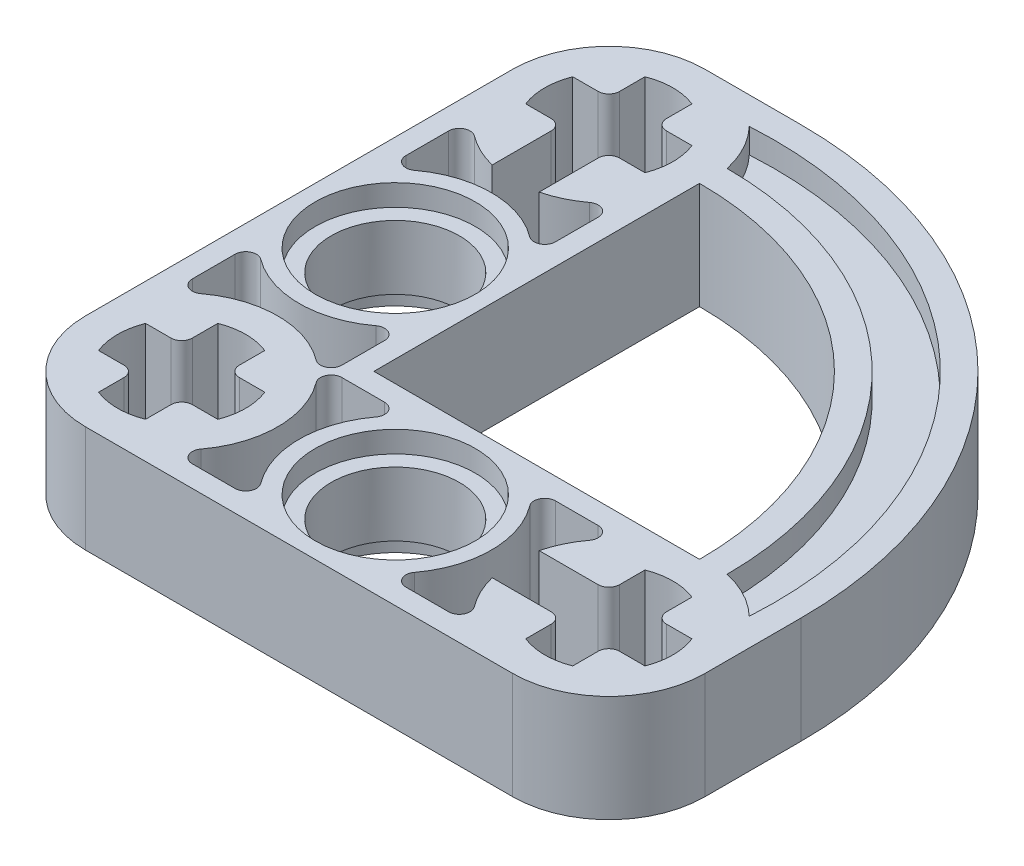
from build123d import *

# Parameters (mm, degrees)
EXTRUDE_1_DEPTH      = 4
CUT_EXTRUDE_1_DEPTH  = 24.160120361
CUT_EXTRUDE_2_DEPTH  = 24.160120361
CUT_EXTRUDE_3_DEPTH  = 24.160120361
CUT_EXTRUDE_4_DEPTH  = 24.160120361
CUT_EXTRUDE_5_DEPTH  = 1
CUT_EXTRUDE_START    = -1
CUT_EXTRUDE_8_DEPTH  = 1
FILLET_1_R           = 0.5
FILLET_2_R           = 3.6
CUT_EXTRUDE_13_DEPTH = 1
BOSS_EXTRUDE1_DEPTH  = 4
SKETCH2_R            = 2.4
CUT_EXTRUDE1_DEPTH   = 24.160120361
SKETCH4_R            = 3
CUT_EXTRUDE2_DEPTH   = 0.8
CUT_EXTRUDE3_START   = -0.8
SKETCH5_R            = 3
CUT_EXTRUDE3_DEPTH   = 0.8


with BuildPart() as part:
    # Sketch 1 → Extrude 1 (new body)
    with BuildSketch(Plane(origin=(0, 3.925, 0), x_dir=(1, 0, 0), z_dir=(0, 1, 0))):
        with BuildLine():
            Line((-11.545003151, 3.589996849), (-11.545003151, -19.610003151))
            Line((-11.545003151, -19.610003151), (11.654996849, -19.610003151))
            Line((11.654996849, -19.610003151), (11.654996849, -12.410003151))
            ThreePointArc((11.654996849, -12.410003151), (6.968705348, -1.096294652), (-4.345003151, 3.589996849))
            Line((-4.345003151, 3.589996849), (-11.545003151, 3.589996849))
        make_face()
        with BuildLine():
            Line((-4.345003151, -12.410003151), (-4.345003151, -0.212116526))
            ThreePointArc((-4.345003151, -0.212116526), (4.280205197, -3.784794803), (7.852883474, -12.410003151))
            Line((7.852883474, -12.410003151), (-4.345003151, -12.410003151))
        make_face(mode=Mode.SUBTRACT)
    extrude(amount=-EXTRUDE_1_DEPTH)

    # Sketch 2 → Cut-Extrude 1 (cut, through all)
    with BuildSketch(Plane(origin=(0, 3.925, 0), x_dir=(-1, 0, 0), z_dir=(0, 1, 0))):
        with BuildLine():
            Line((10.585278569, 3.194236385), (10.585278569, 4.774236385))
            ThreePointArc((10.585278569, 4.774236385), (10.43330167, 5.004217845), (10.162146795, 4.954584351))
            ThreePointArc((10.162146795, 4.954584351), (7.945003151, 4.24526029), (5.727859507, 4.954584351))
            ThreePointArc((5.727859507, 4.954584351), (5.456704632, 5.004217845), (5.304727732, 4.774236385))
            Line((5.304727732, 4.774236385), (5.304727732, 3.194236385))
            ThreePointArc((5.304727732, 3.194236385), (5.456704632, 2.964254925), (5.727859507, 3.013888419))
            ThreePointArc((5.727859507, 3.013888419), (6.402563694, 3.409993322), (7.145003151, 3.65678977))
            Line((7.145003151, 3.65678977), (7.145003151, 0.810003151))
            Line((7.145003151, 0.810003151), (5.545003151, 0.810003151))
            ThreePointArc((5.545003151, 0.810003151), (5.415181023, 0.010003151), (5.545003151, -0.789996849))
            Line((5.545003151, -0.789996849), (7.145003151, -0.789996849))
            Line((7.145003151, -0.789996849), (7.145003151, -2.389996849))
            ThreePointArc((7.145003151, -2.389996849), (7.945003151, -2.519818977), (8.745003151, -2.389996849))
            Line((8.745003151, -2.389996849), (8.745003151, -0.789996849))
            Line((8.745003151, -0.789996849), (10.345003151, -0.789996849))
            ThreePointArc((10.345003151, -0.789996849), (10.474825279, 0.010003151), (10.345003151, 0.810003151))
            Line((10.345003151, 0.810003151), (8.745003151, 0.810003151))
            Line((8.745003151, 0.810003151), (8.745003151, 3.65678977))
            ThreePointArc((8.745003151, 3.65678977), (9.487442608, 3.409993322), (10.162146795, 3.013888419))
            ThreePointArc((10.162146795, 3.013888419), (10.43330167, 2.964254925), (10.585278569, 3.194236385))
        make_face()
    extrude(amount=-CUT_EXTRUDE_1_DEPTH, mode=Mode.SUBTRACT)

    # Sketch 3 → Cut-Extrude 2 (cut, through all)
    with BuildSketch(Plane(origin=(0, 3.925, 0), x_dir=(-1, 0, 0), z_dir=(0, 1, 0))):
        with BuildLine():
            Line((-4.826110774, 13.560227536), (-3.246110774, 13.560227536))
            ThreePointArc((-3.246110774, 13.560227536), (-3.069334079, 13.633450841), (-2.996110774, 13.810227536))
            ThreePointArc((-2.996110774, 13.810227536), (-3.715011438, 16.010003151), (-2.996110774, 18.209778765))
            ThreePointArc((-2.996110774, 18.209778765), (-3.069334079, 18.386555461), (-3.246110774, 18.459778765))
            Line((-3.246110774, 18.459778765), (-4.826110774, 18.459778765))
            ThreePointArc((-4.826110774, 18.459778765), (-5.00288747, 18.386555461), (-5.076110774, 18.209778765))
            ThreePointArc((-5.076110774, 18.209778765), (-4.684277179, 17.543308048), (-4.439367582, 16.810003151))
            Line((-4.439367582, 16.810003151), (-7.254996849, 16.810003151))
            Line((-7.254996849, 16.810003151), (-7.254996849, 18.272744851))
            ThreePointArc((-7.254996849, 18.272744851), (-8.054996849, 18.410003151), (-8.854996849, 18.272744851))
            Line((-8.854996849, 18.272744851), (-8.854996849, 16.810003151))
            Line((-8.854996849, 16.810003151), (-10.317738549, 16.810003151))
            ThreePointArc((-10.317738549, 16.810003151), (-10.454996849, 16.010003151), (-10.317738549, 15.210003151))
            Line((-10.317738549, 15.210003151), (-8.854996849, 15.210003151))
            Line((-8.854996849, 15.210003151), (-8.854996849, 13.747261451))
            ThreePointArc((-8.854996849, 13.747261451), (-8.054996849, 13.610003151), (-7.254996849, 13.747261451))
            Line((-7.254996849, 13.747261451), (-7.254996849, 15.210003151))
            Line((-7.254996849, 15.210003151), (-4.439367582, 15.210003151))
            ThreePointArc((-4.439367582, 15.210003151), (-4.684277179, 14.476698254), (-5.076110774, 13.810227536))
            ThreePointArc((-5.076110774, 13.810227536), (-5.00288747, 13.633450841), (-4.826110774, 13.560227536))
        make_face()
    extrude(amount=-CUT_EXTRUDE_2_DEPTH, mode=Mode.SUBTRACT)

    # Sketch 4 → Cut-Extrude 3 (cut, through all)
    with BuildSketch(Plane(origin=(0, 3.925, 0), x_dir=(-1, 0, 0), z_dir=(0, 1, 0))):
        with BuildLine():
            Line((8.745003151, 13.747261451), (8.745003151, 15.210003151))
            Line((8.745003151, 15.210003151), (10.207744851, 15.210003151))
            ThreePointArc((10.207744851, 15.210003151), (10.345003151, 16.010003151), (10.207744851, 16.810003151))
            Line((10.207744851, 16.810003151), (8.745003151, 16.810003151))
            Line((8.745003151, 16.810003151), (8.745003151, 18.272744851))
            ThreePointArc((8.745003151, 18.272744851), (7.945003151, 18.410003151), (7.145003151, 18.272744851))
            Line((7.145003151, 18.272744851), (7.145003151, 16.810003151))
            Line((7.145003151, 16.810003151), (5.682261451, 16.810003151))
            ThreePointArc((5.682261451, 16.810003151), (5.545003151, 16.010003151), (5.682261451, 15.210003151))
            Line((5.682261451, 15.210003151), (7.145003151, 15.210003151))
            Line((7.145003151, 15.210003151), (7.145003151, 13.747261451))
            ThreePointArc((7.145003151, 13.747261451), (7.945003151, 13.610003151), (8.745003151, 13.747261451))
        make_face()
    extrude(amount=-CUT_EXTRUDE_3_DEPTH, mode=Mode.SUBTRACT)

    # Sketch 5 → Cut-Extrude 4 (cut, through all)
    with BuildSketch(Plane(origin=(0, 3.925, 0), x_dir=(-1, 0, 0), z_dir=(0, 1, 0))):
        with BuildLine():
            Line((5.605171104, 12.8875), (5.605171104, 11.3075))
            ThreePointArc((5.605171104, 11.3075), (5.678394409, 11.130723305), (5.855171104, 11.0575))
            ThreePointArc((5.855171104, 11.0575), (8.065, 11.785), (10.274828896, 11.0575))
            ThreePointArc((10.274828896, 11.0575), (10.451605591, 11.130723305), (10.524828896, 11.3075))
            Line((10.524828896, 11.3075), (10.524828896, 12.8875))
            ThreePointArc((10.524828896, 12.8875), (10.451605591, 13.064276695), (10.274828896, 13.1375))
            ThreePointArc((10.274828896, 13.1375), (8.065, 12.41), (5.855171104, 13.1375))
            ThreePointArc((5.855171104, 13.1375), (5.678394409, 13.064276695), (5.605171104, 12.8875))
        make_face()
    extrude(amount=-CUT_EXTRUDE_4_DEPTH, mode=Mode.SUBTRACT)

    # Sketch 6 → Cut-Extrude 5 (cut)
    with BuildSketch(Plane(origin=(0, 3.925, 0), x_dir=(-1, 0, 0), z_dir=(0, 1, 0))):
        with BuildLine():
            Line((4.8225, 18.589828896), (3.2425, 18.589828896))
            ThreePointArc((3.2425, 18.589828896), (3.065723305, 18.516605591), (2.9925, 18.339828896))
            ThreePointArc((2.9925, 18.339828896), (3.72, 16.13), (2.9925, 13.920171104))
            ThreePointArc((2.9925, 13.920171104), (3.065723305, 13.743394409), (3.2425, 13.670171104))
            Line((3.2425, 13.670171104), (4.8225, 13.670171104))
            ThreePointArc((4.8225, 13.670171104), (4.999276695, 13.743394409), (5.0725, 13.920171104))
            ThreePointArc((5.0725, 13.920171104), (4.345, 16.13), (5.0725, 18.339828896))
            ThreePointArc((5.0725, 18.339828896), (4.999276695, 18.516605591), (4.8225, 18.589828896))
        make_face()
    extrude(amount=-CUT_EXTRUDE_5_DEPTH, mode=Mode.SUBTRACT)

    # Sketch 9 → Cut-Extrude 8 (cut)
    with BuildSketch(Plane.XZ.offset(0.075).offset(CUT_EXTRUDE_START)):
        with BuildLine():
            Line((-3.2425, 18.589828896), (-4.8225, 18.589828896))
            ThreePointArc((-4.8225, 18.589828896), (-4.999276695, 18.516605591), (-5.0725, 18.339828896))
            ThreePointArc((-5.0725, 18.339828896), (-4.345, 16.13), (-5.0725, 13.920171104))
            ThreePointArc((-5.0725, 13.920171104), (-4.999276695, 13.743394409), (-4.8225, 13.670171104))
            Line((-4.8225, 13.670171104), (-3.2425, 13.670171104))
            ThreePointArc((-3.2425, 13.670171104), (-3.065723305, 13.743394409), (-2.9925, 13.920171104))
            ThreePointArc((-2.9925, 13.920171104), (-3.72, 16.13), (-2.9925, 18.339828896))
            ThreePointArc((-2.9925, 18.339828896), (-3.065723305, 18.516605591), (-3.2425, 18.589828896))
        make_face()
    extrude(amount=CUT_EXTRUDE_8_DEPTH, mode=Mode.SUBTRACT)

    # Sketch 14 → Cut-Revolve 1 (revolve, cut)
    with BuildSketch(Plane(origin=(0, 0, 16.13), x_dir=(-1, 0, 0), z_dir=(0, 0, -1)), mode=Mode.PRIVATE) as cut_revolve_1_sk:
        Polygon((-3, -0.075), (0, -0.075), (0, 3.925), (-3, 3.925), (-3, 3.525), (-2.4, 3.525), (-2.4, 0.325), (-3, 0.325), align=None)
    revolve(cut_revolve_1_sk.sketch.rotate(Axis((0, -0.075, 16.13), (0, 1, 0)), 270), axis=Axis((0, -0.075, 16.13), (0, 1, 0)), mode=Mode.SUBTRACT)

    # Sketch 17 → Cut-Revolve 4 (revolve, cut)
    with BuildSketch(Plane(origin=(0, 0, 8.065), x_dir=(-1, 0, 0), z_dir=(0, 0, -1)), mode=Mode.PRIVATE) as cut_revolve_4_sk:
        Polygon((5.065, -0.075), (8.065, -0.075), (8.065, 3.925), (5.065, 3.925), (5.065, 3.525), (5.665, 3.525), (5.665, 0.325), (5.065, 0.325), align=None)
    revolve(cut_revolve_4_sk.sketch.rotate(Axis((-8.065, -0.075, 8.065), (0, 1, 0)), 270), axis=Axis((-8.065, -0.075, 8.065), (0, 1, 0)), mode=Mode.SUBTRACT)

    # Fillet 1
    fillet_1_edges = [part.edges().sort_by_distance(p)[0] for p in [
        (7.254996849, 1.925, 15.210003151),
        (8.854996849, 1.925, 15.210003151),
        (8.854996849, 1.925, 16.810003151),
        (7.254996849, 1.925, 16.810003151),
        (-7.145003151, 1.925, 15.210003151),
        (-7.145003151, 1.925, 16.810003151),
        (-8.745003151, 1.925, 16.810003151),
        (-8.745003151, 1.925, 15.210003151),
        (-8.745003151, 1.925, 0.810003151),
        (-8.745003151, 1.925, -0.789996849),
        (-7.145003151, 1.925, -0.789996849),
        (-7.145003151, 1.925, 0.810003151),
    ]]
    fillet(fillet_1_edges, radius=FILLET_1_R)

    # Fillet 2
    fillet_2_edges = [part.edges().sort_by_distance(p)[0] for p in [
        (11.654996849, 1.925, 19.610003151),
        (-11.545003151, 1.925, 19.610003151),
        (-11.545003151, 1.925, -3.589996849),
    ]]
    fillet(fillet_2_edges, radius=FILLET_2_R)

    # Sketch 18 → Cut-Extrude 13 (cut)
    with BuildSketch(Plane.XZ.offset(0.075)):
        with BuildLine():
            ThreePointArc((8.852043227, 12.376393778), (9.806599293, 12.728191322), (10.630157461, 13.325427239))
            ThreePointArc((10.630157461, 13.325427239), (6.26380066, 1.80119934), (-5.260427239, -2.565157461))
            ThreePointArc((-5.260427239, -2.565157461), (-4.663191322, -1.741599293), (-4.311393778, -0.787043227))
            ThreePointArc((-4.311393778, -0.787043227), (4.986748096, 3.078251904), (8.852043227, 12.376393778))
        make_face()
    cut_extrude_13 = extrude(amount=-CUT_EXTRUDE_13_DEPTH, mode=Mode.SUBTRACT)

    # Mirror 1: Cut-Extrude 13 across plane
    add(cut_extrude_13.mirror(Plane.ZX.offset(1.9625)), mode=Mode.SUBTRACT)

    # Sketch1 → Boss-Extrude1 (add)
    with BuildSketch(Plane(origin=(0, 3.925, 0), x_dir=(1, 0, 0), z_dir=(0, 1, 0))):
        with BuildLine():
            Line((-11.265, -0.010003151), (-11.265, -16.13))
            ThreePointArc((-11.265, -16.13), (-10.3277417, -18.3927417), (-8.065, -19.33))
            Line((-8.065, -19.33), (8.049747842, -19.355285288))
            ThreePointArc((8.049747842, -19.355285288), (11.400282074, -16.012627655), (8.054996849, -12.664716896))
            Line((8.054996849, -12.664716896), (-4.625006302, -12.664716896))
            Line((-4.625006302, -12.664716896), (-4.625006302, -0.010003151))
            ThreePointArc((-4.625006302, -0.010003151), (-7.945003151, 3.309993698), (-11.265, -0.010003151))
        make_face()
    extrude(amount=-BOSS_EXTRUDE1_DEPTH)

    # Sketch2 → Cut-Extrude1 (cut, through all)
    with BuildSketch(Plane(origin=(0, 3.925, 0), x_dir=(1, 0, 0), z_dir=(0, 1, 0))):
        with Locations(Location((-7.945003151, -8.010003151, 0), (0, 0, 270))):
            Circle(SKETCH2_R)
        with Locations(Location((0.054996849, -16.010003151, 0), (0, 0, 270))):
            Circle(SKETCH2_R)
        with BuildLine():
            Line((-8.825003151, 2.222842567), (-8.825003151, 1.269996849))
            ThreePointArc((-8.825003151, 1.269996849), (-8.942160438, 0.987154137), (-9.225003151, 0.869996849))
            Line((-9.225003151, 0.869996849), (-10.177848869, 0.869996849))
            ThreePointArc((-10.177848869, 0.869996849), (-10.345003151, -0.010003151), (-10.177848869, -0.890003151))
            Line((-10.177848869, -0.890003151), (-9.225003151, -0.890003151))
            ThreePointArc((-9.225003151, -0.890003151), (-8.942160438, -1.007160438), (-8.825003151, -1.290003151))
            Line((-8.825003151, -1.290003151), (-8.825003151, -2.242848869))
            Line((-8.825003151, -2.242848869), (-8.825003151, -3.500791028))
            ThreePointArc((-8.825003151, -3.500791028), (-9.495379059, -3.25905448), (-10.105003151, -2.890003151))
            ThreePointArc((-10.105003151, -2.890003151), (-10.523888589, -2.852232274), (-10.745003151, -3.210003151))
            Line((-10.745003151, -3.210003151), (-10.745003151, -4.810003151))
            ThreePointArc((-10.745003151, -4.810003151), (-10.523888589, -5.167774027), (-10.105003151, -5.130003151))
            ThreePointArc((-10.105003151, -5.130003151), (-7.945003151, -4.410003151), (-5.785003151, -5.130003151))
            ThreePointArc((-5.785003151, -5.130003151), (-5.366117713, -5.167774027), (-5.145003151, -4.810003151))
            Line((-5.145003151, -4.810003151), (-5.145003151, -3.210003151))
            ThreePointArc((-5.145003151, -3.210003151), (-5.366117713, -2.852232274), (-5.785003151, -2.890003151))
            ThreePointArc((-5.785003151, -2.890003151), (-6.394627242, -3.25905448), (-7.065003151, -3.500791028))
            Line((-7.065003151, -3.500791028), (-7.065003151, -2.242848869))
            Line((-7.065003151, -2.242848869), (-7.065003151, -1.290003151))
            ThreePointArc((-7.065003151, -1.290003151), (-6.947845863, -1.007160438), (-6.665003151, -0.890003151))
            Line((-6.665003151, -0.890003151), (-5.712157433, -0.890003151))
            ThreePointArc((-5.712157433, -0.890003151), (-5.545003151, -0.010003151), (-5.712157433, 0.869996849))
            Line((-5.712157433, 0.869996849), (-6.665003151, 0.869996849))
            ThreePointArc((-6.665003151, 0.869996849), (-6.947845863, 0.987154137), (-7.065003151, 1.269996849))
            Line((-7.065003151, 1.269996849), (-7.065003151, 2.222842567))
            ThreePointArc((-7.065003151, 2.222842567), (-7.945003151, 2.389996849), (-8.825003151, 2.222842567))
        make_face()
        with BuildLine():
            Line((-8.825003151, -13.777157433), (-8.825003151, -14.730003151))
            ThreePointArc((-8.825003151, -14.730003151), (-8.942160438, -15.012845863), (-9.225003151, -15.130003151))
            Line((-9.225003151, -15.130003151), (-10.177848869, -15.130003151))
            ThreePointArc((-10.177848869, -15.130003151), (-10.345003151, -16.010003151), (-10.177848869, -16.890003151))
            Line((-10.177848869, -16.890003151), (-9.225003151, -16.890003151))
            ThreePointArc((-9.225003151, -16.890003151), (-8.942160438, -17.007160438), (-8.825003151, -17.290003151))
            Line((-8.825003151, -17.290003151), (-8.825003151, -18.242848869))
            ThreePointArc((-8.825003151, -18.242848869), (-7.945003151, -18.410003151), (-7.065003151, -18.242848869))
            Line((-7.065003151, -18.242848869), (-7.065003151, -17.290003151))
            ThreePointArc((-7.065003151, -17.290003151), (-6.947845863, -17.007160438), (-6.665003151, -16.890003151))
            Line((-6.665003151, -16.890003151), (-5.712157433, -16.890003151))
            ThreePointArc((-5.712157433, -16.890003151), (-5.545003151, -16.010003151), (-5.712157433, -15.130003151))
            Line((-5.712157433, -15.130003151), (-6.665003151, -15.130003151))
            ThreePointArc((-6.665003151, -15.130003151), (-6.947845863, -15.012845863), (-7.065003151, -14.730003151))
            Line((-7.065003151, -14.730003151), (-7.065003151, -13.777157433))
            ThreePointArc((-7.065003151, -13.777157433), (-7.945003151, -13.610003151), (-8.825003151, -13.777157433))
        make_face()
        with BuildLine():
            Line((-10.745003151, -11.210003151), (-10.745003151, -12.810003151))
            ThreePointArc((-10.745003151, -12.810003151), (-10.523888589, -13.167774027), (-10.105003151, -13.130003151))
            ThreePointArc((-10.105003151, -13.130003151), (-7.945003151, -12.410003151), (-5.785003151, -13.130003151))
            ThreePointArc((-5.785003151, -13.130003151), (-5.366117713, -13.167774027), (-5.145003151, -12.810003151))
            Line((-5.145003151, -12.810003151), (-5.145003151, -11.210003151))
            ThreePointArc((-5.145003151, -11.210003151), (-5.366117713, -10.852232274), (-5.785003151, -10.890003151))
            ThreePointArc((-5.785003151, -10.890003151), (-7.945003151, -11.610003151), (-10.105003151, -10.890003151))
            ThreePointArc((-10.105003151, -10.890003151), (-10.523888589, -10.852232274), (-10.745003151, -11.210003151))
        make_face()
        with BuildLine():
            Line((10.287842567, -15.130003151), (9.334996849, -15.130003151))
            ThreePointArc((9.334996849, -15.130003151), (9.052154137, -15.012845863), (8.934996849, -14.730003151))
            Line((8.934996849, -14.730003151), (8.934996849, -13.777157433))
            ThreePointArc((8.934996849, -13.777157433), (8.054996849, -13.610003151), (7.174996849, -13.777157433))
            Line((7.174996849, -13.777157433), (7.174996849, -14.730003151))
            ThreePointArc((7.174996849, -14.730003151), (7.057839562, -15.012845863), (6.774996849, -15.130003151))
            Line((6.774996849, -15.130003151), (5.822151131, -15.130003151))
            Line((5.822151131, -15.130003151), (4.564208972, -15.130003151))
            ThreePointArc((4.564208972, -15.130003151), (4.80594552, -14.459627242), (5.174996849, -13.850003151))
            ThreePointArc((5.174996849, -13.850003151), (5.212767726, -13.431117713), (4.854996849, -13.210003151))
            Line((4.854996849, -13.210003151), (3.254996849, -13.210003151))
            ThreePointArc((3.254996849, -13.210003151), (2.897225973, -13.431117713), (2.934996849, -13.850003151))
            ThreePointArc((2.934996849, -13.850003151), (3.654996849, -16.010003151), (2.934996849, -18.170003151))
            ThreePointArc((2.934996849, -18.170003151), (2.897225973, -18.588888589), (3.254996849, -18.810003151))
            Line((3.254996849, -18.810003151), (4.854996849, -18.810003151))
            ThreePointArc((4.854996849, -18.810003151), (5.212767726, -18.588888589), (5.174996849, -18.170003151))
            ThreePointArc((5.174996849, -18.170003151), (4.80594552, -17.560379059), (4.564208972, -16.890003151))
            Line((4.564208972, -16.890003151), (5.822151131, -16.890003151))
            Line((5.822151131, -16.890003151), (6.774996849, -16.890003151))
            ThreePointArc((6.774996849, -16.890003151), (7.057839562, -17.007160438), (7.174996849, -17.290003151))
            Line((7.174996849, -17.290003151), (7.174996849, -18.242848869))
            ThreePointArc((7.174996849, -18.242848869), (8.054996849, -18.410003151), (8.934996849, -18.242848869))
            Line((8.934996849, -18.242848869), (8.934996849, -17.290003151))
            ThreePointArc((8.934996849, -17.290003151), (9.052154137, -17.007160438), (9.334996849, -16.890003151))
            Line((9.334996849, -16.890003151), (10.287842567, -16.890003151))
            ThreePointArc((10.287842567, -16.890003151), (10.454996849, -16.010003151), (10.287842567, -15.130003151))
        make_face()
        with BuildLine():
            Line((-3.145003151, -13.210003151), (-4.745003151, -13.210003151))
            ThreePointArc((-4.745003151, -13.210003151), (-5.102774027, -13.431117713), (-5.065003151, -13.850003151))
            ThreePointArc((-5.065003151, -13.850003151), (-4.345003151, -16.010003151), (-5.065003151, -18.170003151))
            ThreePointArc((-5.065003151, -18.170003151), (-5.102774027, -18.588888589), (-4.745003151, -18.810003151))
            Line((-4.745003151, -18.810003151), (-3.145003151, -18.810003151))
            ThreePointArc((-3.145003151, -18.810003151), (-2.787232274, -18.588888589), (-2.825003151, -18.170003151))
            ThreePointArc((-2.825003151, -18.170003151), (-3.545003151, -16.010003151), (-2.825003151, -13.850003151))
            ThreePointArc((-2.825003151, -13.850003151), (-2.787232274, -13.431117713), (-3.145003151, -13.210003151))
        make_face()
    extrude(amount=-CUT_EXTRUDE1_DEPTH, mode=Mode.SUBTRACT)

    # Sketch4 → Cut-Extrude2 (cut)
    with BuildSketch(Plane(origin=(0, 3.925, 0), x_dir=(1, 0, 0), z_dir=(0, 1, 0))):
        with Locations(Location((-7.945003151, -8.010003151, 0), (0, 0, 270))):
            Circle(SKETCH4_R)
        with Locations(Location((0.054996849, -16.010003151, 0), (0, 0, 270))):
            Circle(SKETCH4_R)
    extrude(amount=-CUT_EXTRUDE2_DEPTH, mode=Mode.SUBTRACT)

    # Sketch5 → Cut-Extrude3 (cut)
    with BuildSketch(Plane.XZ.offset(0.075).offset(CUT_EXTRUDE3_START)):
        with Locations(Location((-7.945003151, 8.010003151, 0), (0, 0, 90))):
            Circle(SKETCH5_R)
        with Locations(Location((0.054996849, 16.010003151, 0), (0, 0, 90))):
            Circle(SKETCH5_R)
    extrude(amount=CUT_EXTRUDE3_DEPTH, mode=Mode.SUBTRACT)


solid = part.part
